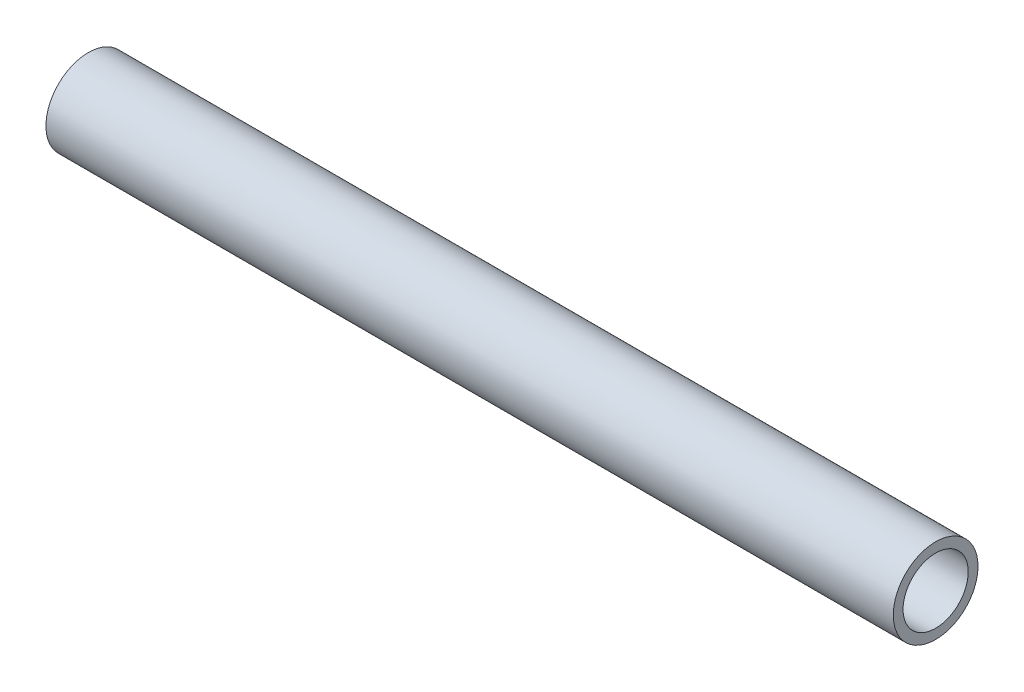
ISO-10303-21;
HEADER;
FILE_DESCRIPTION(('STEP AP214'),'2;1');
FILE_NAME('part.step','',(''),(''),'','','');
FILE_SCHEMA(('AUTOMOTIVE_DESIGN { 1 0 10303 214 1 1 1 1 }'));
ENDSEC;
DATA;
#1=APPLICATION_CONTEXT('core data for automotive mechanical design processes');
#2=APPLICATION_PROTOCOL_DEFINITION('international standard','automotive_design',2000,#1);
#3=PRODUCT_CONTEXT('',#1,'mechanical');
#4=PRODUCT('Part','Part','',(#3));
#5=PRODUCT_RELATED_PRODUCT_CATEGORY('part','',(#4));
#6=PRODUCT_DEFINITION_FORMATION('','',#4);
#7=PRODUCT_DEFINITION_CONTEXT('part definition',#1,'design');
#8=PRODUCT_DEFINITION('design','',#6,#7);
#9=PRODUCT_DEFINITION_SHAPE('','',#8);
#10=(LENGTH_UNIT() NAMED_UNIT(*) SI_UNIT(.MILLI.,.METRE.));
#11=(NAMED_UNIT(*) PLANE_ANGLE_UNIT() SI_UNIT($,.RADIAN.));
#12=(NAMED_UNIT(*) SI_UNIT($,.STERADIAN.) SOLID_ANGLE_UNIT());
#13=UNCERTAINTY_MEASURE_WITH_UNIT(LENGTH_MEASURE(1.E-05),#10,'distance_accuracy_value','');
#14=(GEOMETRIC_REPRESENTATION_CONTEXT(3) GLOBAL_UNCERTAINTY_ASSIGNED_CONTEXT((#13)) GLOBAL_UNIT_ASSIGNED_CONTEXT((#10,
#11,#12)) REPRESENTATION_CONTEXT('',''));
#15=CARTESIAN_POINT('',(0.,0.,0.));
#16=DIRECTION('',(0.,0.,1.));
#17=DIRECTION('',(1.,0.,0.));
#18=AXIS2_PLACEMENT_3D('',#15,#16,#17);
#19=CARTESIAN_POINT('',(330.2,0.,0.));
#20=DIRECTION('',(-1.,0.,0.));
#21=DIRECTION('',(0.,0.,1.));
#22=AXIS2_PLACEMENT_3D('',#19,#20,#21);
#23=CYLINDRICAL_SURFACE('',#22,12.7);
#24=CARTESIAN_POINT('',(330.2,0.,0.));
#25=DIRECTION('',(1.,0.,0.));
#26=DIRECTION('',(0.,0.,-1.));
#27=AXIS2_PLACEMENT_3D('',#24,#25,#26);
#28=CIRCLE('',#27,12.7);
#29=CARTESIAN_POINT('',(330.2,0.,-12.7));
#30=VERTEX_POINT('',#29);
#31=EDGE_CURVE('E53',#30,#30,#28,.T.);
#32=ORIENTED_EDGE('',*,*,#31,.T.);
#33=EDGE_LOOP('',(#32));
#34=FACE_BOUND('',#33,.T.);
#35=CARTESIAN_POINT('',(0.,0.,0.));
#36=DIRECTION('',(1.,0.,0.));
#37=DIRECTION('',(0.,0.,-1.));
#38=AXIS2_PLACEMENT_3D('',#35,#36,#37);
#39=CIRCLE('',#38,12.7);
#40=CARTESIAN_POINT('',(0.,0.,-12.7));
#41=VERTEX_POINT('',#40);
#42=EDGE_CURVE('E60',#41,#41,#39,.T.);
#43=ORIENTED_EDGE('',*,*,#42,.F.);
#44=EDGE_LOOP('',(#43));
#45=FACE_BOUND('',#44,.T.);
#46=ADVANCED_FACE('F45',(#34,#45),#23,.F.);
#47=CARTESIAN_POINT('',(330.2,0.,0.));
#48=DIRECTION('',(-1.,0.,0.));
#49=DIRECTION('',(0.,0.,1.));
#50=AXIS2_PLACEMENT_3D('',#47,#48,#49);
#51=CYLINDRICAL_SURFACE('',#50,16.51);
#52=CARTESIAN_POINT('',(330.2,0.,0.));
#53=DIRECTION('',(1.,0.,0.));
#54=DIRECTION('',(0.,0.,-1.));
#55=AXIS2_PLACEMENT_3D('',#52,#53,#54);
#56=CIRCLE('',#55,16.51);
#57=CARTESIAN_POINT('',(330.2,0.,-16.51));
#58=VERTEX_POINT('',#57);
#59=EDGE_CURVE('E10',#58,#58,#56,.T.);
#60=ORIENTED_EDGE('',*,*,#59,.F.);
#61=EDGE_LOOP('',(#60));
#62=FACE_BOUND('',#61,.T.);
#63=CARTESIAN_POINT('',(0.,0.,0.));
#64=DIRECTION('',(1.,0.,0.));
#65=DIRECTION('',(0.,0.,-1.));
#66=AXIS2_PLACEMENT_3D('',#63,#64,#65);
#67=CIRCLE('',#66,16.51);
#68=CARTESIAN_POINT('',(0.,0.,-16.51));
#69=VERTEX_POINT('',#68);
#70=EDGE_CURVE('E48',#69,#69,#67,.T.);
#71=ORIENTED_EDGE('',*,*,#70,.T.);
#72=EDGE_LOOP('',(#71));
#73=FACE_BOUND('',#72,.T.);
#74=ADVANCED_FACE('F69',(#62,#73),#51,.T.);
#75=CARTESIAN_POINT('',(330.2,0.,0.));
#76=DIRECTION('',(1.,0.,0.));
#77=DIRECTION('',(0.,0.,-1.));
#78=AXIS2_PLACEMENT_3D('',#75,#76,#77);
#79=PLANE('',#78);
#80=ORIENTED_EDGE('',*,*,#31,.F.);
#81=EDGE_LOOP('',(#80));
#82=FACE_BOUND('',#81,.T.);
#83=ORIENTED_EDGE('',*,*,#59,.T.);
#84=EDGE_LOOP('',(#83));
#85=FACE_BOUND('',#84,.T.);
#86=ADVANCED_FACE('F73',(#82,#85),#79,.T.);
#87=CARTESIAN_POINT('',(0.,0.,0.));
#88=DIRECTION('',(1.,0.,0.));
#89=DIRECTION('',(0.,0.,-1.));
#90=AXIS2_PLACEMENT_3D('',#87,#88,#89);
#91=PLANE('',#90);
#92=ORIENTED_EDGE('',*,*,#42,.T.);
#93=EDGE_LOOP('',(#92));
#94=FACE_BOUND('',#93,.T.);
#95=ORIENTED_EDGE('',*,*,#70,.F.);
#96=EDGE_LOOP('',(#95));
#97=FACE_BOUND('',#96,.T.);
#98=ADVANCED_FACE('F71',(#94,#97),#91,.F.);
#99=CLOSED_SHELL('',(#46,#74,#86,#98));
#100=MANIFOLD_SOLID_BREP('B2',#99);
#101=ADVANCED_BREP_SHAPE_REPRESENTATION('',(#18,#100),#14);
#102=SHAPE_DEFINITION_REPRESENTATION(#9,#101);
ENDSEC;
END-ISO-10303-21;
